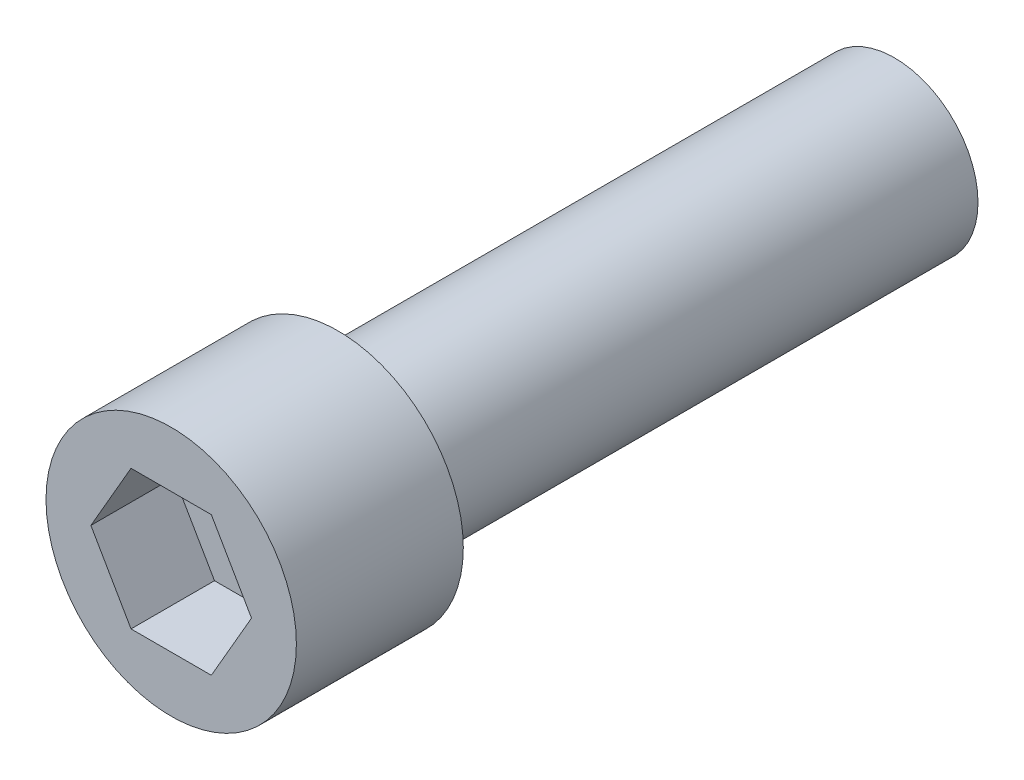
ISO-10303-21;
HEADER;
FILE_DESCRIPTION(('STEP AP214'),'2;1');
FILE_NAME('part.step','',(''),(''),'','','');
FILE_SCHEMA(('AUTOMOTIVE_DESIGN { 1 0 10303 214 1 1 1 1 }'));
ENDSEC;
DATA;
#1=APPLICATION_CONTEXT('core data for automotive mechanical design processes');
#2=APPLICATION_PROTOCOL_DEFINITION('international standard','automotive_design',2000,#1);
#3=PRODUCT_CONTEXT('',#1,'mechanical');
#4=PRODUCT('Part','Part','',(#3));
#5=PRODUCT_RELATED_PRODUCT_CATEGORY('part','',(#4));
#6=PRODUCT_DEFINITION_FORMATION('','',#4);
#7=PRODUCT_DEFINITION_CONTEXT('part definition',#1,'design');
#8=PRODUCT_DEFINITION('design','',#6,#7);
#9=PRODUCT_DEFINITION_SHAPE('','',#8);
#10=(LENGTH_UNIT() NAMED_UNIT(*) SI_UNIT(.MILLI.,.METRE.));
#11=(NAMED_UNIT(*) PLANE_ANGLE_UNIT() SI_UNIT($,.RADIAN.));
#12=(NAMED_UNIT(*) SI_UNIT($,.STERADIAN.) SOLID_ANGLE_UNIT());
#13=UNCERTAINTY_MEASURE_WITH_UNIT(LENGTH_MEASURE(1.E-05),#10,'distance_accuracy_value','');
#14=(GEOMETRIC_REPRESENTATION_CONTEXT(3) GLOBAL_UNCERTAINTY_ASSIGNED_CONTEXT((#13)) GLOBAL_UNIT_ASSIGNED_CONTEXT((#10,
#11,#12)) REPRESENTATION_CONTEXT('',''));
#15=CARTESIAN_POINT('',(0.,0.,0.));
#16=DIRECTION('',(0.,0.,1.));
#17=DIRECTION('',(1.,0.,0.));
#18=AXIS2_PLACEMENT_3D('',#15,#16,#17);
#19=CARTESIAN_POINT('',(0.,0.,40.));
#20=DIRECTION('',(0.,0.,-1.));
#21=DIRECTION('',(-1.,0.,0.));
#22=AXIS2_PLACEMENT_3D('',#19,#20,#21);
#23=CYLINDRICAL_SURFACE('',#22,6.);
#24=CARTESIAN_POINT('',(0.,0.,40.));
#25=DIRECTION('',(0.,0.,1.));
#26=DIRECTION('',(1.,0.,0.));
#27=AXIS2_PLACEMENT_3D('',#24,#25,#26);
#28=CIRCLE('',#27,6.);
#29=CARTESIAN_POINT('',(6.,0.,40.));
#30=VERTEX_POINT('',#29);
#31=EDGE_CURVE('E9',#30,#30,#28,.T.);
#32=ORIENTED_EDGE('',*,*,#31,.F.);
#33=EDGE_LOOP('',(#32));
#34=FACE_BOUND('',#33,.T.);
#35=CARTESIAN_POINT('',(0.,0.,0.));
#36=DIRECTION('',(0.,0.,1.));
#37=DIRECTION('',(1.,0.,0.));
#38=AXIS2_PLACEMENT_3D('',#35,#36,#37);
#39=CIRCLE('',#38,6.);
#40=CARTESIAN_POINT('',(6.,0.,0.));
#41=VERTEX_POINT('',#40);
#42=EDGE_CURVE('E21',#41,#41,#39,.T.);
#43=ORIENTED_EDGE('',*,*,#42,.T.);
#44=EDGE_LOOP('',(#43));
#45=FACE_BOUND('',#44,.T.);
#46=ADVANCED_FACE('F14',(#34,#45),#23,.T.);
#47=CARTESIAN_POINT('',(0.,0.,0.));
#48=DIRECTION('',(0.,0.,1.));
#49=DIRECTION('',(1.,0.,0.));
#50=AXIS2_PLACEMENT_3D('',#47,#48,#49);
#51=PLANE('',#50);
#52=ORIENTED_EDGE('',*,*,#42,.F.);
#53=EDGE_LOOP('',(#52));
#54=FACE_BOUND('',#53,.T.);
#55=ADVANCED_FACE('F131',(#54),#51,.F.);
#56=CARTESIAN_POINT('',(0.,0.,40.));
#57=DIRECTION('',(0.,0.,1.));
#58=DIRECTION('',(1.,0.,0.));
#59=AXIS2_PLACEMENT_3D('',#56,#57,#58);
#60=PLANE('',#59);
#61=CARTESIAN_POINT('',(0.,0.,40.));
#62=DIRECTION('',(0.,0.,1.));
#63=DIRECTION('',(1.,0.,0.));
#64=AXIS2_PLACEMENT_3D('',#61,#62,#63);
#65=CIRCLE('',#64,9.);
#66=CARTESIAN_POINT('',(9.,0.,40.));
#67=VERTEX_POINT('',#66);
#68=EDGE_CURVE('E116',#67,#67,#65,.T.);
#69=ORIENTED_EDGE('',*,*,#68,.F.);
#70=EDGE_LOOP('',(#69));
#71=FACE_BOUND('',#70,.T.);
#72=ORIENTED_EDGE('',*,*,#31,.T.);
#73=EDGE_LOOP('',(#72));
#74=FACE_BOUND('',#73,.T.);
#75=ADVANCED_FACE('F133',(#71,#74),#60,.F.);
#76=CARTESIAN_POINT('',(0.,0.,52.));
#77=DIRECTION('',(0.,0.,-1.));
#78=DIRECTION('',(-1.,0.,0.));
#79=AXIS2_PLACEMENT_3D('',#76,#77,#78);
#80=CYLINDRICAL_SURFACE('',#79,9.);
#81=CARTESIAN_POINT('',(0.,0.,52.));
#82=DIRECTION('',(0.,0.,1.));
#83=DIRECTION('',(1.,0.,0.));
#84=AXIS2_PLACEMENT_3D('',#81,#82,#83);
#85=CIRCLE('',#84,9.);
#86=CARTESIAN_POINT('',(9.,0.,52.));
#87=VERTEX_POINT('',#86);
#88=EDGE_CURVE('E125',#87,#87,#85,.T.);
#89=ORIENTED_EDGE('',*,*,#88,.F.);
#90=EDGE_LOOP('',(#89));
#91=FACE_BOUND('',#90,.T.);
#92=ORIENTED_EDGE('',*,*,#68,.T.);
#93=EDGE_LOOP('',(#92));
#94=FACE_BOUND('',#93,.T.);
#95=ADVANCED_FACE('F140',(#91,#94),#80,.T.);
#96=CARTESIAN_POINT('',(0.,0.,52.));
#97=DIRECTION('',(0.,0.,1.));
#98=DIRECTION('',(1.,0.,0.));
#99=AXIS2_PLACEMENT_3D('',#96,#97,#98);
#100=PLANE('',#99);
#101=DIRECTION('',(0.5,0.866025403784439,0.));
#102=VECTOR('',#101,1.);
#103=CARTESIAN_POINT('',(2.88675134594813,-5.,52.));
#104=LINE('',#103,#102);
#105=CARTESIAN_POINT('',(2.88675134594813,-5.,52.));
#106=VERTEX_POINT('',#105);
#107=CARTESIAN_POINT('',(5.77350269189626,0.,52.));
#108=VERTEX_POINT('',#107);
#109=EDGE_CURVE('E28',#106,#108,#104,.T.);
#110=ORIENTED_EDGE('',*,*,#109,.F.);
#111=DIRECTION('',(1.,0.,0.));
#112=VECTOR('',#111,1.);
#113=CARTESIAN_POINT('',(-2.88675134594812,-5.,52.));
#114=LINE('',#113,#112);
#115=CARTESIAN_POINT('',(-2.88675134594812,-5.,52.));
#116=VERTEX_POINT('',#115);
#117=EDGE_CURVE('E98',#116,#106,#114,.T.);
#118=ORIENTED_EDGE('',*,*,#117,.F.);
#119=DIRECTION('',(0.5,-0.866025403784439,0.));
#120=VECTOR('',#119,1.);
#121=CARTESIAN_POINT('',(-5.77350269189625,0.,52.));
#122=LINE('',#121,#120);
#123=CARTESIAN_POINT('',(-5.77350269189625,0.,52.));
#124=VERTEX_POINT('',#123);
#125=EDGE_CURVE('E92',#124,#116,#122,.T.);
#126=ORIENTED_EDGE('',*,*,#125,.F.);
#127=DIRECTION('',(-0.5,-0.866025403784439,0.));
#128=VECTOR('',#127,1.);
#129=CARTESIAN_POINT('',(-2.88675134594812,5.,52.));
#130=LINE('',#129,#128);
#131=CARTESIAN_POINT('',(-2.88675134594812,5.,52.));
#132=VERTEX_POINT('',#131);
#133=EDGE_CURVE('E90',#132,#124,#130,.T.);
#134=ORIENTED_EDGE('',*,*,#133,.F.);
#135=DIRECTION('',(-1.,0.,0.));
#136=VECTOR('',#135,1.);
#137=CARTESIAN_POINT('',(2.88675134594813,5.,52.));
#138=LINE('',#137,#136);
#139=CARTESIAN_POINT('',(2.88675134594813,5.,52.));
#140=VERTEX_POINT('',#139);
#141=EDGE_CURVE('E71',#140,#132,#138,.T.);
#142=ORIENTED_EDGE('',*,*,#141,.F.);
#143=DIRECTION('',(-0.5,0.866025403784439,0.));
#144=VECTOR('',#143,1.);
#145=CARTESIAN_POINT('',(5.77350269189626,0.,52.));
#146=LINE('',#145,#144);
#147=EDGE_CURVE('E82',#108,#140,#146,.T.);
#148=ORIENTED_EDGE('',*,*,#147,.F.);
#149=EDGE_LOOP('',(#110,#118,#126,#134,#142,#148));
#150=FACE_BOUND('',#149,.T.);
#151=ORIENTED_EDGE('',*,*,#88,.T.);
#152=EDGE_LOOP('',(#151));
#153=FACE_BOUND('',#152,.T.);
#154=ADVANCED_FACE('F86',(#150,#153),#100,.T.);
#155=CARTESIAN_POINT('',(2.88675134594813,-5.,46.));
#156=DIRECTION('',(0.866025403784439,-0.5,0.));
#157=DIRECTION('',(0.5,0.866025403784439,0.));
#158=AXIS2_PLACEMENT_3D('',#155,#156,#157);
#159=PLANE('',#158);
#160=ORIENTED_EDGE('',*,*,#109,.T.);
#161=DIRECTION('',(0.,0.,1.));
#162=VECTOR('',#161,1.);
#163=CARTESIAN_POINT('',(5.77350269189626,0.,46.));
#164=LINE('',#163,#162);
#165=CARTESIAN_POINT('',(5.77350269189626,0.,46.));
#166=VERTEX_POINT('',#165);
#167=EDGE_CURVE('E79',#166,#108,#164,.T.);
#168=ORIENTED_EDGE('',*,*,#167,.F.);
#169=DIRECTION('',(0.5,0.866025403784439,0.));
#170=VECTOR('',#169,1.);
#171=CARTESIAN_POINT('',(2.88675134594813,-5.,46.));
#172=LINE('',#171,#170);
#173=CARTESIAN_POINT('',(2.88675134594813,-5.,46.));
#174=VERTEX_POINT('',#173);
#175=EDGE_CURVE('E100',#174,#166,#172,.T.);
#176=ORIENTED_EDGE('',*,*,#175,.F.);
#177=DIRECTION('',(0.,0.,1.));
#178=VECTOR('',#177,1.);
#179=CARTESIAN_POINT('',(2.88675134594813,-5.,46.));
#180=LINE('',#179,#178);
#181=EDGE_CURVE('E35',#174,#106,#180,.T.);
#182=ORIENTED_EDGE('',*,*,#181,.T.);
#183=EDGE_LOOP('',(#160,#168,#176,#182));
#184=FACE_BOUND('',#183,.T.);
#185=ADVANCED_FACE('F149',(#184),#159,.F.);
#186=CARTESIAN_POINT('',(-2.88675134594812,-5.,46.));
#187=DIRECTION('',(0.,-1.,0.));
#188=DIRECTION('',(0.,0.,-1.));
#189=AXIS2_PLACEMENT_3D('',#186,#187,#188);
#190=PLANE('',#189);
#191=ORIENTED_EDGE('',*,*,#117,.T.);
#192=ORIENTED_EDGE('',*,*,#181,.F.);
#193=DIRECTION('',(1.,0.,0.));
#194=VECTOR('',#193,1.);
#195=CARTESIAN_POINT('',(-2.88675134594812,-5.,46.));
#196=LINE('',#195,#194);
#197=CARTESIAN_POINT('',(-2.88675134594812,-5.,46.));
#198=VERTEX_POINT('',#197);
#199=EDGE_CURVE('E112',#198,#174,#196,.T.);
#200=ORIENTED_EDGE('',*,*,#199,.F.);
#201=DIRECTION('',(0.,0.,1.));
#202=VECTOR('',#201,1.);
#203=CARTESIAN_POINT('',(-2.88675134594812,-5.,46.));
#204=LINE('',#203,#202);
#205=EDGE_CURVE('E117',#198,#116,#204,.T.);
#206=ORIENTED_EDGE('',*,*,#205,.T.);
#207=EDGE_LOOP('',(#191,#192,#200,#206));
#208=FACE_BOUND('',#207,.T.);
#209=ADVANCED_FACE('F153',(#208),#190,.F.);
#210=CARTESIAN_POINT('',(-5.77350269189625,0.,46.));
#211=DIRECTION('',(-0.866025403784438,-0.5,0.));
#212=DIRECTION('',(0.5,-0.866025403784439,0.));
#213=AXIS2_PLACEMENT_3D('',#210,#211,#212);
#214=PLANE('',#213);
#215=ORIENTED_EDGE('',*,*,#125,.T.);
#216=ORIENTED_EDGE('',*,*,#205,.F.);
#217=DIRECTION('',(0.5,-0.866025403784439,0.));
#218=VECTOR('',#217,1.);
#219=CARTESIAN_POINT('',(-5.77350269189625,0.,46.));
#220=LINE('',#219,#218);
#221=CARTESIAN_POINT('',(-5.77350269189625,0.,46.));
#222=VERTEX_POINT('',#221);
#223=EDGE_CURVE('E109',#222,#198,#220,.T.);
#224=ORIENTED_EDGE('',*,*,#223,.F.);
#225=DIRECTION('',(0.,0.,1.));
#226=VECTOR('',#225,1.);
#227=CARTESIAN_POINT('',(-5.77350269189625,0.,46.));
#228=LINE('',#227,#226);
#229=EDGE_CURVE('E119',#222,#124,#228,.T.);
#230=ORIENTED_EDGE('',*,*,#229,.T.);
#231=EDGE_LOOP('',(#215,#216,#224,#230));
#232=FACE_BOUND('',#231,.T.);
#233=ADVANCED_FACE('F162',(#232),#214,.F.);
#234=CARTESIAN_POINT('',(-2.88675134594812,5.,46.));
#235=DIRECTION('',(-0.866025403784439,0.5,0.));
#236=DIRECTION('',(-0.5,-0.866025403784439,0.));
#237=AXIS2_PLACEMENT_3D('',#234,#235,#236);
#238=PLANE('',#237);
#239=ORIENTED_EDGE('',*,*,#133,.T.);
#240=ORIENTED_EDGE('',*,*,#229,.F.);
#241=DIRECTION('',(-0.5,-0.866025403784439,0.));
#242=VECTOR('',#241,1.);
#243=CARTESIAN_POINT('',(-2.88675134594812,5.,46.));
#244=LINE('',#243,#242);
#245=CARTESIAN_POINT('',(-2.88675134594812,5.,46.));
#246=VERTEX_POINT('',#245);
#247=EDGE_CURVE('E106',#246,#222,#244,.T.);
#248=ORIENTED_EDGE('',*,*,#247,.F.);
#249=DIRECTION('',(0.,0.,1.));
#250=VECTOR('',#249,1.);
#251=CARTESIAN_POINT('',(-2.88675134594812,5.,46.));
#252=LINE('',#251,#250);
#253=EDGE_CURVE('E78',#246,#132,#252,.T.);
#254=ORIENTED_EDGE('',*,*,#253,.T.);
#255=EDGE_LOOP('',(#239,#240,#248,#254));
#256=FACE_BOUND('',#255,.T.);
#257=ADVANCED_FACE('F159',(#256),#238,.F.);
#258=CARTESIAN_POINT('',(2.88675134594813,5.,46.));
#259=DIRECTION('',(0.,1.,0.));
#260=DIRECTION('',(-1.,0.,0.));
#261=AXIS2_PLACEMENT_3D('',#258,#259,#260);
#262=PLANE('',#261);
#263=ORIENTED_EDGE('',*,*,#141,.T.);
#264=ORIENTED_EDGE('',*,*,#253,.F.);
#265=DIRECTION('',(-1.,0.,0.));
#266=VECTOR('',#265,1.);
#267=CARTESIAN_POINT('',(2.88675134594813,5.,46.));
#268=LINE('',#267,#266);
#269=CARTESIAN_POINT('',(2.88675134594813,5.,46.));
#270=VERTEX_POINT('',#269);
#271=EDGE_CURVE('E74',#270,#246,#268,.T.);
#272=ORIENTED_EDGE('',*,*,#271,.F.);
#273=DIRECTION('',(0.,0.,1.));
#274=VECTOR('',#273,1.);
#275=CARTESIAN_POINT('',(2.88675134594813,5.,46.));
#276=LINE('',#275,#274);
#277=EDGE_CURVE('E67',#270,#140,#276,.T.);
#278=ORIENTED_EDGE('',*,*,#277,.T.);
#279=EDGE_LOOP('',(#263,#264,#272,#278));
#280=FACE_BOUND('',#279,.T.);
#281=ADVANCED_FACE('F69',(#280),#262,.F.);
#282=CARTESIAN_POINT('',(5.77350269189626,0.,46.));
#283=DIRECTION('',(0.866025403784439,0.5,0.));
#284=DIRECTION('',(-0.5,0.866025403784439,0.));
#285=AXIS2_PLACEMENT_3D('',#282,#283,#284);
#286=PLANE('',#285);
#287=ORIENTED_EDGE('',*,*,#147,.T.);
#288=ORIENTED_EDGE('',*,*,#277,.F.);
#289=DIRECTION('',(-0.5,0.866025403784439,0.));
#290=VECTOR('',#289,1.);
#291=CARTESIAN_POINT('',(5.77350269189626,0.,46.));
#292=LINE('',#291,#290);
#293=EDGE_CURVE('E103',#166,#270,#292,.T.);
#294=ORIENTED_EDGE('',*,*,#293,.F.);
#295=ORIENTED_EDGE('',*,*,#167,.T.);
#296=EDGE_LOOP('',(#287,#288,#294,#295));
#297=FACE_BOUND('',#296,.T.);
#298=ADVANCED_FACE('F83',(#297),#286,.F.);
#299=CARTESIAN_POINT('',(2.88675134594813,-5.,46.));
#300=DIRECTION('',(0.,0.,-1.));
#301=DIRECTION('',(-1.,0.,0.));
#302=AXIS2_PLACEMENT_3D('',#299,#300,#301);
#303=PLANE('',#302);
#304=ORIENTED_EDGE('',*,*,#175,.T.);
#305=ORIENTED_EDGE('',*,*,#293,.T.);
#306=ORIENTED_EDGE('',*,*,#271,.T.);
#307=ORIENTED_EDGE('',*,*,#247,.T.);
#308=ORIENTED_EDGE('',*,*,#223,.T.);
#309=ORIENTED_EDGE('',*,*,#199,.T.);
#310=EDGE_LOOP('',(#304,#305,#306,#307,#308,#309));
#311=FACE_BOUND('',#310,.T.);
#312=ADVANCED_FACE('F156',(#311),#303,.F.);
#313=CLOSED_SHELL('',(#46,#55,#75,#95,#154,#185,#209,#233,#257,#281,#298,#312));
#314=MANIFOLD_SOLID_BREP('B1',#313);
#315=ADVANCED_BREP_SHAPE_REPRESENTATION('',(#18,#314),#14);
#316=SHAPE_DEFINITION_REPRESENTATION(#9,#315);
ENDSEC;
END-ISO-10303-21;
